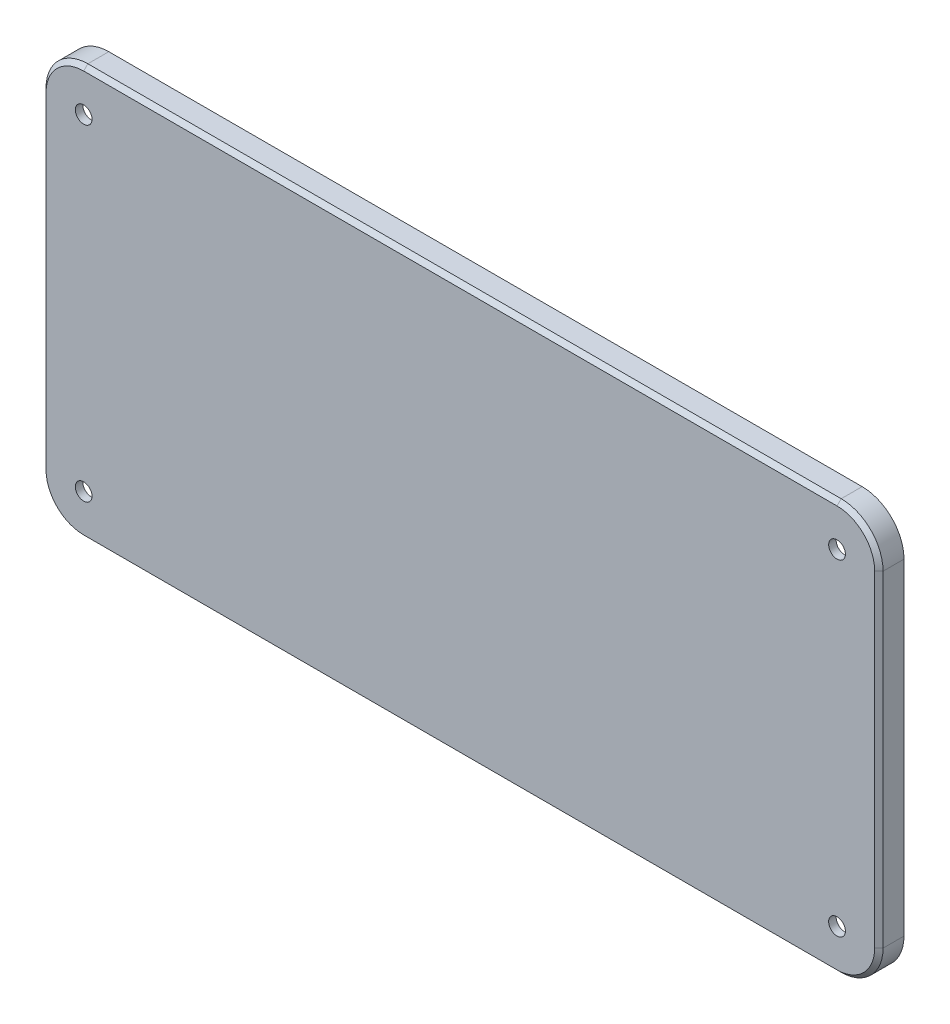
ISO-10303-21;
HEADER;
FILE_DESCRIPTION(('STEP AP214'),'2;1');
FILE_NAME('part.step','',(''),(''),'','','');
FILE_SCHEMA(('AUTOMOTIVE_DESIGN { 1 0 10303 214 1 1 1 1 }'));
ENDSEC;
DATA;
#1=APPLICATION_CONTEXT('core data for automotive mechanical design processes');
#2=APPLICATION_PROTOCOL_DEFINITION('international standard','automotive_design',2000,#1);
#3=PRODUCT_CONTEXT('',#1,'mechanical');
#4=PRODUCT('Part','Part','',(#3));
#5=PRODUCT_RELATED_PRODUCT_CATEGORY('part','',(#4));
#6=PRODUCT_DEFINITION_FORMATION('','',#4);
#7=PRODUCT_DEFINITION_CONTEXT('part definition',#1,'design');
#8=PRODUCT_DEFINITION('design','',#6,#7);
#9=PRODUCT_DEFINITION_SHAPE('','',#8);
#10=(LENGTH_UNIT() NAMED_UNIT(*) SI_UNIT(.MILLI.,.METRE.));
#11=(NAMED_UNIT(*) PLANE_ANGLE_UNIT() SI_UNIT($,.RADIAN.));
#12=(NAMED_UNIT(*) SI_UNIT($,.STERADIAN.) SOLID_ANGLE_UNIT());
#13=UNCERTAINTY_MEASURE_WITH_UNIT(LENGTH_MEASURE(1.E-05),#10,'distance_accuracy_value','');
#14=(GEOMETRIC_REPRESENTATION_CONTEXT(3) GLOBAL_UNCERTAINTY_ASSIGNED_CONTEXT((#13)) GLOBAL_UNIT_ASSIGNED_CONTEXT((#10,
#11,#12)) REPRESENTATION_CONTEXT('',''));
#15=CARTESIAN_POINT('',(0.,0.,0.));
#16=DIRECTION('',(0.,0.,1.));
#17=DIRECTION('',(1.,0.,0.));
#18=AXIS2_PLACEMENT_3D('',#15,#16,#17);
#19=CARTESIAN_POINT('',(-90.0000000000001,-39.,6.));
#20=DIRECTION('',(0.,0.,1.));
#21=DIRECTION('',(1.,0.,0.));
#22=AXIS2_PLACEMENT_3D('',#19,#20,#21);
#23=PLANE('',#22);
#24=CARTESIAN_POINT('',(-90.0000000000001,-39.,6.));
#25=DIRECTION('',(0.,0.,1.));
#26=DIRECTION('',(1.,0.,0.));
#27=AXIS2_PLACEMENT_3D('',#24,#25,#26);
#28=CIRCLE('',#27,9.00000000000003);
#29=CARTESIAN_POINT('',(-99.0000000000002,-39.,6.));
#30=VERTEX_POINT('',#29);
#31=CARTESIAN_POINT('',(-90.0000000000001,-48.,6.));
#32=VERTEX_POINT('',#31);
#33=EDGE_CURVE('E300',#30,#32,#28,.T.);
#34=ORIENTED_EDGE('',*,*,#33,.T.);
#35=DIRECTION('',(1.,0.,0.));
#36=VECTOR('',#35,1.);
#37=CARTESIAN_POINT('',(90.0000000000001,-48.,6.));
#38=LINE('',#37,#36);
#39=CARTESIAN_POINT('',(90.0000000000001,-48.,6.));
#40=VERTEX_POINT('',#39);
#41=EDGE_CURVE('E304',#32,#40,#38,.T.);
#42=ORIENTED_EDGE('',*,*,#41,.T.);
#43=CARTESIAN_POINT('',(90.0000000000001,-39.,6.));
#44=DIRECTION('',(0.,0.,1.));
#45=DIRECTION('',(1.,0.,0.));
#46=AXIS2_PLACEMENT_3D('',#43,#44,#45);
#47=CIRCLE('',#46,9.00000000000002);
#48=CARTESIAN_POINT('',(99.0000000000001,-39.,6.));
#49=VERTEX_POINT('',#48);
#50=EDGE_CURVE('E302',#40,#49,#47,.T.);
#51=ORIENTED_EDGE('',*,*,#50,.T.);
#52=DIRECTION('',(0.,1.,0.));
#53=VECTOR('',#52,1.);
#54=CARTESIAN_POINT('',(99.0000000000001,39.,6.));
#55=LINE('',#54,#53);
#56=CARTESIAN_POINT('',(99.0000000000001,39.,6.));
#57=VERTEX_POINT('',#56);
#58=EDGE_CURVE('E298',#49,#57,#55,.T.);
#59=ORIENTED_EDGE('',*,*,#58,.T.);
#60=CARTESIAN_POINT('',(90.0000000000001,39.,6.));
#61=DIRECTION('',(0.,0.,1.));
#62=DIRECTION('',(1.,0.,0.));
#63=AXIS2_PLACEMENT_3D('',#60,#61,#62);
#64=CIRCLE('',#63,9.00000000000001);
#65=CARTESIAN_POINT('',(90.0000000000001,48.,6.));
#66=VERTEX_POINT('',#65);
#67=EDGE_CURVE('E294',#57,#66,#64,.T.);
#68=ORIENTED_EDGE('',*,*,#67,.T.);
#69=DIRECTION('',(-1.,0.,0.));
#70=VECTOR('',#69,1.);
#71=CARTESIAN_POINT('',(-90.0000000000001,48.,6.));
#72=LINE('',#71,#70);
#73=CARTESIAN_POINT('',(-90.0000000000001,48.,6.));
#74=VERTEX_POINT('',#73);
#75=EDGE_CURVE('E290',#66,#74,#72,.T.);
#76=ORIENTED_EDGE('',*,*,#75,.T.);
#77=CARTESIAN_POINT('',(-90.0000000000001,39.,6.));
#78=DIRECTION('',(0.,0.,1.));
#79=DIRECTION('',(1.,0.,0.));
#80=AXIS2_PLACEMENT_3D('',#77,#78,#79);
#81=CIRCLE('',#80,9.00000000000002);
#82=CARTESIAN_POINT('',(-99.0000000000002,39.,6.));
#83=VERTEX_POINT('',#82);
#84=EDGE_CURVE('E292',#74,#83,#81,.T.);
#85=ORIENTED_EDGE('',*,*,#84,.T.);
#86=DIRECTION('',(0.,-1.,0.));
#87=VECTOR('',#86,1.);
#88=CARTESIAN_POINT('',(-99.0000000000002,-39.,6.));
#89=LINE('',#88,#87);
#90=EDGE_CURVE('E296',#83,#30,#89,.T.);
#91=ORIENTED_EDGE('',*,*,#90,.T.);
#92=EDGE_LOOP('',(#34,#42,#51,#59,#68,#76,#85,#91));
#93=FACE_BOUND('',#92,.T.);
#94=CARTESIAN_POINT('',(89.9999999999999,39.,6.));
#95=DIRECTION('',(0.,0.,1.));
#96=DIRECTION('',(1.,0.,0.));
#97=AXIS2_PLACEMENT_3D('',#94,#95,#96);
#98=CIRCLE('',#97,2.);
#99=CARTESIAN_POINT('',(91.9999999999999,39.,6.));
#100=VERTEX_POINT('',#99);
#101=EDGE_CURVE('E241',#100,#100,#98,.T.);
#102=ORIENTED_EDGE('',*,*,#101,.F.);
#103=EDGE_LOOP('',(#102));
#104=FACE_BOUND('',#103,.T.);
#105=CARTESIAN_POINT('',(-89.9999999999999,-39.,6.));
#106=DIRECTION('',(0.,0.,1.));
#107=DIRECTION('',(1.,0.,0.));
#108=AXIS2_PLACEMENT_3D('',#105,#106,#107);
#109=CIRCLE('',#108,2.);
#110=CARTESIAN_POINT('',(-87.9999999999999,-39.,6.));
#111=VERTEX_POINT('',#110);
#112=EDGE_CURVE('E247',#111,#111,#109,.T.);
#113=ORIENTED_EDGE('',*,*,#112,.F.);
#114=EDGE_LOOP('',(#113));
#115=FACE_BOUND('',#114,.T.);
#116=CARTESIAN_POINT('',(90.0000000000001,-39.,6.));
#117=DIRECTION('',(0.,0.,1.));
#118=DIRECTION('',(1.,0.,0.));
#119=AXIS2_PLACEMENT_3D('',#116,#117,#118);
#120=CIRCLE('',#119,2.);
#121=CARTESIAN_POINT('',(92.0000000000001,-39.,6.));
#122=VERTEX_POINT('',#121);
#123=EDGE_CURVE('E244',#122,#122,#120,.T.);
#124=ORIENTED_EDGE('',*,*,#123,.F.);
#125=EDGE_LOOP('',(#124));
#126=FACE_BOUND('',#125,.T.);
#127=CARTESIAN_POINT('',(-90.0000000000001,39.,6.));
#128=DIRECTION('',(0.,0.,1.));
#129=DIRECTION('',(1.,0.,0.));
#130=AXIS2_PLACEMENT_3D('',#127,#128,#129);
#131=CIRCLE('',#130,2.);
#132=CARTESIAN_POINT('',(-88.0000000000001,39.,6.));
#133=VERTEX_POINT('',#132);
#134=EDGE_CURVE('E238',#133,#133,#131,.T.);
#135=ORIENTED_EDGE('',*,*,#134,.F.);
#136=EDGE_LOOP('',(#135));
#137=FACE_BOUND('',#136,.T.);
#138=ADVANCED_FACE('F33',(#93,#104,#115,#126,#137),#23,.T.);
#139=CARTESIAN_POINT('',(-90.0000000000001,-39.,0.));
#140=DIRECTION('',(0.,0.,1.));
#141=DIRECTION('',(1.,0.,0.));
#142=AXIS2_PLACEMENT_3D('',#139,#140,#141);
#143=PLANE('',#142);
#144=DIRECTION('',(0.,-1.,0.));
#145=VECTOR('',#144,1.);
#146=CARTESIAN_POINT('',(-98.2000000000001,-39.,0.));
#147=LINE('',#146,#145);
#148=CARTESIAN_POINT('',(-98.2000000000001,39.,0.));
#149=VERTEX_POINT('',#148);
#150=CARTESIAN_POINT('',(-98.2000000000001,-39.,0.));
#151=VERTEX_POINT('',#150);
#152=EDGE_CURVE('E198',#149,#151,#147,.T.);
#153=ORIENTED_EDGE('',*,*,#152,.T.);
#154=CARTESIAN_POINT('',(-90.0000000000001,-39.,0.));
#155=DIRECTION('',(0.,0.,1.));
#156=DIRECTION('',(1.,0.,0.));
#157=AXIS2_PLACEMENT_3D('',#154,#155,#156);
#158=CIRCLE('',#157,8.2);
#159=CARTESIAN_POINT('',(-90.0000000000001,-47.2,0.));
#160=VERTEX_POINT('',#159);
#161=EDGE_CURVE('E207',#151,#160,#158,.T.);
#162=ORIENTED_EDGE('',*,*,#161,.T.);
#163=DIRECTION('',(1.,0.,0.));
#164=VECTOR('',#163,1.);
#165=CARTESIAN_POINT('',(90.0000000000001,-47.2,0.));
#166=LINE('',#165,#164);
#167=CARTESIAN_POINT('',(90.0000000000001,-47.2,0.));
#168=VERTEX_POINT('',#167);
#169=EDGE_CURVE('E214',#160,#168,#166,.T.);
#170=ORIENTED_EDGE('',*,*,#169,.T.);
#171=CARTESIAN_POINT('',(90.0000000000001,-39.,0.));
#172=DIRECTION('',(0.,0.,1.));
#173=DIRECTION('',(1.,0.,0.));
#174=AXIS2_PLACEMENT_3D('',#171,#172,#173);
#175=CIRCLE('',#174,8.19999999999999);
#176=CARTESIAN_POINT('',(98.2000000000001,-39.,0.));
#177=VERTEX_POINT('',#176);
#178=EDGE_CURVE('E234',#168,#177,#175,.T.);
#179=ORIENTED_EDGE('',*,*,#178,.T.);
#180=DIRECTION('',(0.,1.,0.));
#181=VECTOR('',#180,1.);
#182=CARTESIAN_POINT('',(98.2000000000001,-39.,0.));
#183=LINE('',#182,#181);
#184=CARTESIAN_POINT('',(98.2000000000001,39.,0.));
#185=VERTEX_POINT('',#184);
#186=EDGE_CURVE('E231',#177,#185,#183,.T.);
#187=ORIENTED_EDGE('',*,*,#186,.T.);
#188=CARTESIAN_POINT('',(90.0000000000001,39.,0.));
#189=DIRECTION('',(0.,0.,1.));
#190=DIRECTION('',(1.,0.,0.));
#191=AXIS2_PLACEMENT_3D('',#188,#189,#190);
#192=CIRCLE('',#191,8.19999999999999);
#193=CARTESIAN_POINT('',(90.0000000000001,47.2,0.));
#194=VERTEX_POINT('',#193);
#195=EDGE_CURVE('E228',#185,#194,#192,.T.);
#196=ORIENTED_EDGE('',*,*,#195,.T.);
#197=DIRECTION('',(-1.,0.,0.));
#198=VECTOR('',#197,1.);
#199=CARTESIAN_POINT('',(90.0000000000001,47.2,0.));
#200=LINE('',#199,#198);
#201=CARTESIAN_POINT('',(-90.0000000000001,47.2,0.));
#202=VERTEX_POINT('',#201);
#203=EDGE_CURVE('E223',#194,#202,#200,.T.);
#204=ORIENTED_EDGE('',*,*,#203,.T.);
#205=CARTESIAN_POINT('',(-90.0000000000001,39.,0.));
#206=DIRECTION('',(0.,0.,1.));
#207=DIRECTION('',(1.,0.,0.));
#208=AXIS2_PLACEMENT_3D('',#205,#206,#207);
#209=CIRCLE('',#208,8.2);
#210=EDGE_CURVE('E221',#202,#149,#209,.T.);
#211=ORIENTED_EDGE('',*,*,#210,.T.);
#212=EDGE_LOOP('',(#153,#162,#170,#179,#187,#196,#204,#211));
#213=FACE_BOUND('',#212,.T.);
#214=CARTESIAN_POINT('',(-90.0000000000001,-39.,0.));
#215=DIRECTION('',(0.,0.,1.));
#216=DIRECTION('',(1.,0.,0.));
#217=AXIS2_PLACEMENT_3D('',#214,#215,#216);
#218=CIRCLE('',#217,10.);
#219=CARTESIAN_POINT('',(-100.,-39.,0.));
#220=VERTEX_POINT('',#219);
#221=CARTESIAN_POINT('',(-90.0000000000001,-49.,0.));
#222=VERTEX_POINT('',#221);
#223=EDGE_CURVE('E250',#220,#222,#218,.T.);
#224=ORIENTED_EDGE('',*,*,#223,.F.);
#225=DIRECTION('',(0.,-1.,0.));
#226=VECTOR('',#225,1.);
#227=CARTESIAN_POINT('',(-100.,-39.,0.));
#228=LINE('',#227,#226);
#229=CARTESIAN_POINT('',(-100.,39.,0.));
#230=VERTEX_POINT('',#229);
#231=EDGE_CURVE('E271',#230,#220,#228,.T.);
#232=ORIENTED_EDGE('',*,*,#231,.F.);
#233=CARTESIAN_POINT('',(-90.0000000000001,39.,0.));
#234=DIRECTION('',(0.,0.,1.));
#235=DIRECTION('',(1.,0.,0.));
#236=AXIS2_PLACEMENT_3D('',#233,#234,#235);
#237=CIRCLE('',#236,9.99999999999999);
#238=CARTESIAN_POINT('',(-90.0000000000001,49.,0.));
#239=VERTEX_POINT('',#238);
#240=EDGE_CURVE('E268',#239,#230,#237,.T.);
#241=ORIENTED_EDGE('',*,*,#240,.F.);
#242=DIRECTION('',(-1.,0.,0.));
#243=VECTOR('',#242,1.);
#244=CARTESIAN_POINT('',(90.0000000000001,49.,0.));
#245=LINE('',#244,#243);
#246=CARTESIAN_POINT('',(90.0000000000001,49.,0.));
#247=VERTEX_POINT('',#246);
#248=EDGE_CURVE('E265',#247,#239,#245,.T.);
#249=ORIENTED_EDGE('',*,*,#248,.F.);
#250=CARTESIAN_POINT('',(90.0000000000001,39.,0.));
#251=DIRECTION('',(0.,0.,1.));
#252=DIRECTION('',(1.,0.,0.));
#253=AXIS2_PLACEMENT_3D('',#250,#251,#252);
#254=CIRCLE('',#253,9.99999999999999);
#255=CARTESIAN_POINT('',(100.,39.,0.));
#256=VERTEX_POINT('',#255);
#257=EDGE_CURVE('E262',#256,#247,#254,.T.);
#258=ORIENTED_EDGE('',*,*,#257,.F.);
#259=DIRECTION('',(0.,1.,0.));
#260=VECTOR('',#259,1.);
#261=CARTESIAN_POINT('',(100.,-39.,0.));
#262=LINE('',#261,#260);
#263=CARTESIAN_POINT('',(100.,-39.,0.));
#264=VERTEX_POINT('',#263);
#265=EDGE_CURVE('E259',#264,#256,#262,.T.);
#266=ORIENTED_EDGE('',*,*,#265,.F.);
#267=CARTESIAN_POINT('',(90.0000000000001,-39.,0.));
#268=DIRECTION('',(0.,0.,1.));
#269=DIRECTION('',(1.,0.,0.));
#270=AXIS2_PLACEMENT_3D('',#267,#268,#269);
#271=CIRCLE('',#270,9.99999999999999);
#272=CARTESIAN_POINT('',(90.0000000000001,-49.,0.));
#273=VERTEX_POINT('',#272);
#274=EDGE_CURVE('E256',#273,#264,#271,.T.);
#275=ORIENTED_EDGE('',*,*,#274,.F.);
#276=DIRECTION('',(1.,0.,0.));
#277=VECTOR('',#276,1.);
#278=CARTESIAN_POINT('',(90.0000000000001,-49.,0.));
#279=LINE('',#278,#277);
#280=EDGE_CURVE('E253',#222,#273,#279,.T.);
#281=ORIENTED_EDGE('',*,*,#280,.F.);
#282=EDGE_LOOP('',(#224,#232,#241,#249,#258,#266,#275,#281));
#283=FACE_BOUND('',#282,.T.);
#284=ADVANCED_FACE('F217',(#213,#283),#143,.F.);
#285=CARTESIAN_POINT('',(-90.0000000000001,-39.,6.));
#286=DIRECTION('',(0.,0.,-1.));
#287=DIRECTION('',(-1.,0.,0.));
#288=AXIS2_PLACEMENT_3D('',#285,#286,#287);
#289=CYLINDRICAL_SURFACE('',#288,10.);
#290=DIRECTION('',(0.,0.,-1.));
#291=VECTOR('',#290,1.);
#292=CARTESIAN_POINT('',(-90.0000000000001,-49.,6.));
#293=LINE('',#292,#291);
#294=CARTESIAN_POINT('',(-90.0000000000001,-49.,5.));
#295=VERTEX_POINT('',#294);
#296=EDGE_CURVE('E288',#295,#222,#293,.T.);
#297=ORIENTED_EDGE('',*,*,#296,.F.);
#298=CARTESIAN_POINT('',(-90.0000000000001,-39.,5.));
#299=DIRECTION('',(0.,0.,1.));
#300=DIRECTION('',(1.,0.,0.));
#301=AXIS2_PLACEMENT_3D('',#298,#299,#300);
#302=CIRCLE('',#301,10.);
#303=CARTESIAN_POINT('',(-100.,-39.,5.));
#304=VERTEX_POINT('',#303);
#305=EDGE_CURVE('E312',#295,#304,#302,.F.);
#306=ORIENTED_EDGE('',*,*,#305,.T.);
#307=DIRECTION('',(0.,0.,-1.));
#308=VECTOR('',#307,1.);
#309=CARTESIAN_POINT('',(-100.,-39.,6.));
#310=LINE('',#309,#308);
#311=EDGE_CURVE('E274',#304,#220,#310,.T.);
#312=ORIENTED_EDGE('',*,*,#311,.T.);
#313=ORIENTED_EDGE('',*,*,#223,.T.);
#314=EDGE_LOOP('',(#297,#306,#312,#313));
#315=FACE_BOUND('',#314,.T.);
#316=ADVANCED_FACE('F465',(#315),#289,.T.);
#317=CARTESIAN_POINT('',(90.0000000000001,-49.,6.));
#318=DIRECTION('',(0.,1.,0.));
#319=DIRECTION('',(0.,0.,1.));
#320=AXIS2_PLACEMENT_3D('',#317,#318,#319);
#321=PLANE('',#320);
#322=DIRECTION('',(0.,0.,-1.));
#323=VECTOR('',#322,1.);
#324=CARTESIAN_POINT('',(90.0000000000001,-49.,6.));
#325=LINE('',#324,#323);
#326=CARTESIAN_POINT('',(90.0000000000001,-49.,5.));
#327=VERTEX_POINT('',#326);
#328=EDGE_CURVE('E286',#327,#273,#325,.T.);
#329=ORIENTED_EDGE('',*,*,#328,.F.);
#330=DIRECTION('',(-1.,0.,0.));
#331=VECTOR('',#330,1.);
#332=CARTESIAN_POINT('',(-90.0000000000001,-49.,5.));
#333=LINE('',#332,#331);
#334=EDGE_CURVE('E307',#327,#295,#333,.T.);
#335=ORIENTED_EDGE('',*,*,#334,.T.);
#336=ORIENTED_EDGE('',*,*,#296,.T.);
#337=ORIENTED_EDGE('',*,*,#280,.T.);
#338=EDGE_LOOP('',(#329,#335,#336,#337));
#339=FACE_BOUND('',#338,.T.);
#340=ADVANCED_FACE('F495',(#339),#321,.F.);
#341=CARTESIAN_POINT('',(90.0000000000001,-39.,6.));
#342=DIRECTION('',(0.,0.,-1.));
#343=DIRECTION('',(-1.,0.,0.));
#344=AXIS2_PLACEMENT_3D('',#341,#342,#343);
#345=CYLINDRICAL_SURFACE('',#344,9.99999999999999);
#346=DIRECTION('',(0.,0.,-1.));
#347=VECTOR('',#346,1.);
#348=CARTESIAN_POINT('',(100.,-39.,6.));
#349=LINE('',#348,#347);
#350=CARTESIAN_POINT('',(100.,-39.,5.));
#351=VERTEX_POINT('',#350);
#352=EDGE_CURVE('E284',#351,#264,#349,.T.);
#353=ORIENTED_EDGE('',*,*,#352,.F.);
#354=CARTESIAN_POINT('',(90.0000000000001,-39.,5.));
#355=DIRECTION('',(0.,0.,1.));
#356=DIRECTION('',(1.,0.,0.));
#357=AXIS2_PLACEMENT_3D('',#354,#355,#356);
#358=CIRCLE('',#357,9.99999999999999);
#359=EDGE_CURVE('E310',#351,#327,#358,.F.);
#360=ORIENTED_EDGE('',*,*,#359,.T.);
#361=ORIENTED_EDGE('',*,*,#328,.T.);
#362=ORIENTED_EDGE('',*,*,#274,.T.);
#363=EDGE_LOOP('',(#353,#360,#361,#362));
#364=FACE_BOUND('',#363,.T.);
#365=ADVANCED_FACE('F491',(#364),#345,.T.);
#366=CARTESIAN_POINT('',(100.,-39.,6.));
#367=DIRECTION('',(-1.,0.,0.));
#368=DIRECTION('',(0.,0.,1.));
#369=AXIS2_PLACEMENT_3D('',#366,#367,#368);
#370=PLANE('',#369);
#371=DIRECTION('',(0.,0.,-1.));
#372=VECTOR('',#371,1.);
#373=CARTESIAN_POINT('',(100.,39.,6.));
#374=LINE('',#373,#372);
#375=CARTESIAN_POINT('',(100.,39.,5.));
#376=VERTEX_POINT('',#375);
#377=EDGE_CURVE('E282',#376,#256,#374,.T.);
#378=ORIENTED_EDGE('',*,*,#377,.F.);
#379=DIRECTION('',(0.,-1.,0.));
#380=VECTOR('',#379,1.);
#381=CARTESIAN_POINT('',(100.,-39.,5.));
#382=LINE('',#381,#380);
#383=EDGE_CURVE('E314',#376,#351,#382,.T.);
#384=ORIENTED_EDGE('',*,*,#383,.T.);
#385=ORIENTED_EDGE('',*,*,#352,.T.);
#386=ORIENTED_EDGE('',*,*,#265,.T.);
#387=EDGE_LOOP('',(#378,#384,#385,#386));
#388=FACE_BOUND('',#387,.T.);
#389=ADVANCED_FACE('F487',(#388),#370,.F.);
#390=CARTESIAN_POINT('',(90.0000000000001,39.,6.));
#391=DIRECTION('',(0.,0.,-1.));
#392=DIRECTION('',(-1.,0.,0.));
#393=AXIS2_PLACEMENT_3D('',#390,#391,#392);
#394=CYLINDRICAL_SURFACE('',#393,9.99999999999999);
#395=DIRECTION('',(0.,0.,-1.));
#396=VECTOR('',#395,1.);
#397=CARTESIAN_POINT('',(90.0000000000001,49.,6.));
#398=LINE('',#397,#396);
#399=CARTESIAN_POINT('',(90.0000000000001,49.,5.));
#400=VERTEX_POINT('',#399);
#401=EDGE_CURVE('E280',#400,#247,#398,.T.);
#402=ORIENTED_EDGE('',*,*,#401,.F.);
#403=CARTESIAN_POINT('',(90.0000000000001,39.,5.));
#404=DIRECTION('',(0.,0.,1.));
#405=DIRECTION('',(1.,0.,0.));
#406=AXIS2_PLACEMENT_3D('',#403,#404,#405);
#407=CIRCLE('',#406,9.99999999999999);
#408=EDGE_CURVE('E318',#400,#376,#407,.F.);
#409=ORIENTED_EDGE('',*,*,#408,.T.);
#410=ORIENTED_EDGE('',*,*,#377,.T.);
#411=ORIENTED_EDGE('',*,*,#257,.T.);
#412=EDGE_LOOP('',(#402,#409,#410,#411));
#413=FACE_BOUND('',#412,.T.);
#414=ADVANCED_FACE('F483',(#413),#394,.T.);
#415=CARTESIAN_POINT('',(90.0000000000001,49.,6.));
#416=DIRECTION('',(0.,-1.,0.));
#417=DIRECTION('',(1.,0.,0.));
#418=AXIS2_PLACEMENT_3D('',#415,#416,#417);
#419=PLANE('',#418);
#420=DIRECTION('',(0.,0.,-1.));
#421=VECTOR('',#420,1.);
#422=CARTESIAN_POINT('',(-90.0000000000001,49.,6.));
#423=LINE('',#422,#421);
#424=CARTESIAN_POINT('',(-90.0000000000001,49.,5.));
#425=VERTEX_POINT('',#424);
#426=EDGE_CURVE('E278',#425,#239,#423,.T.);
#427=ORIENTED_EDGE('',*,*,#426,.F.);
#428=DIRECTION('',(1.,0.,0.));
#429=VECTOR('',#428,1.);
#430=CARTESIAN_POINT('',(90.0000000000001,49.,5.));
#431=LINE('',#430,#429);
#432=EDGE_CURVE('E322',#425,#400,#431,.T.);
#433=ORIENTED_EDGE('',*,*,#432,.T.);
#434=ORIENTED_EDGE('',*,*,#401,.T.);
#435=ORIENTED_EDGE('',*,*,#248,.T.);
#436=EDGE_LOOP('',(#427,#433,#434,#435));
#437=FACE_BOUND('',#436,.T.);
#438=ADVANCED_FACE('F479',(#437),#419,.F.);
#439=CARTESIAN_POINT('',(-90.0000000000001,39.,6.));
#440=DIRECTION('',(0.,0.,-1.));
#441=DIRECTION('',(-1.,0.,0.));
#442=AXIS2_PLACEMENT_3D('',#439,#440,#441);
#443=CYLINDRICAL_SURFACE('',#442,9.99999999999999);
#444=DIRECTION('',(0.,0.,-1.));
#445=VECTOR('',#444,1.);
#446=CARTESIAN_POINT('',(-100.,39.,6.));
#447=LINE('',#446,#445);
#448=CARTESIAN_POINT('',(-100.,39.,5.));
#449=VERTEX_POINT('',#448);
#450=EDGE_CURVE('E276',#449,#230,#447,.T.);
#451=ORIENTED_EDGE('',*,*,#450,.F.);
#452=CARTESIAN_POINT('',(-90.0000000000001,39.,5.));
#453=DIRECTION('',(0.,0.,1.));
#454=DIRECTION('',(1.,0.,0.));
#455=AXIS2_PLACEMENT_3D('',#452,#453,#454);
#456=CIRCLE('',#455,9.99999999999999);
#457=EDGE_CURVE('E320',#449,#425,#456,.F.);
#458=ORIENTED_EDGE('',*,*,#457,.T.);
#459=ORIENTED_EDGE('',*,*,#426,.T.);
#460=ORIENTED_EDGE('',*,*,#240,.T.);
#461=EDGE_LOOP('',(#451,#458,#459,#460));
#462=FACE_BOUND('',#461,.T.);
#463=ADVANCED_FACE('F475',(#462),#443,.T.);
#464=CARTESIAN_POINT('',(-100.,-39.,6.));
#465=DIRECTION('',(1.,0.,0.));
#466=DIRECTION('',(0.,0.,-1.));
#467=AXIS2_PLACEMENT_3D('',#464,#465,#466);
#468=PLANE('',#467);
#469=ORIENTED_EDGE('',*,*,#311,.F.);
#470=DIRECTION('',(0.,1.,0.));
#471=VECTOR('',#470,1.);
#472=CARTESIAN_POINT('',(-100.,39.,5.));
#473=LINE('',#472,#471);
#474=EDGE_CURVE('E316',#304,#449,#473,.T.);
#475=ORIENTED_EDGE('',*,*,#474,.T.);
#476=ORIENTED_EDGE('',*,*,#450,.T.);
#477=ORIENTED_EDGE('',*,*,#231,.T.);
#478=EDGE_LOOP('',(#469,#475,#476,#477));
#479=FACE_BOUND('',#478,.T.);
#480=ADVANCED_FACE('F472',(#479),#468,.F.);
#481=CARTESIAN_POINT('',(-89.9999999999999,-39.,6.));
#482=DIRECTION('',(0.,0.,-1.));
#483=DIRECTION('',(-1.,0.,0.));
#484=AXIS2_PLACEMENT_3D('',#481,#482,#483);
#485=CYLINDRICAL_SURFACE('',#484,2.);
#486=CARTESIAN_POINT('',(-89.9999999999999,-39.,4.2));
#487=DIRECTION('',(0.,0.,1.));
#488=DIRECTION('',(1.,0.,0.));
#489=AXIS2_PLACEMENT_3D('',#486,#487,#488);
#490=CIRCLE('',#489,2.);
#491=CARTESIAN_POINT('',(-87.9999999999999,-39.,4.2));
#492=VERTEX_POINT('',#491);
#493=EDGE_CURVE('E215',#492,#492,#490,.T.);
#494=ORIENTED_EDGE('',*,*,#493,.F.);
#495=EDGE_LOOP('',(#494));
#496=FACE_BOUND('',#495,.T.);
#497=ORIENTED_EDGE('',*,*,#112,.T.);
#498=EDGE_LOOP('',(#497));
#499=FACE_BOUND('',#498,.T.);
#500=ADVANCED_FACE('F469',(#496,#499),#485,.F.);
#501=CARTESIAN_POINT('',(90.0000000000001,-39.,6.));
#502=DIRECTION('',(0.,0.,-1.));
#503=DIRECTION('',(-1.,0.,0.));
#504=AXIS2_PLACEMENT_3D('',#501,#502,#503);
#505=CYLINDRICAL_SURFACE('',#504,2.);
#506=CARTESIAN_POINT('',(90.0000000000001,-39.,4.2));
#507=DIRECTION('',(0.,0.,1.));
#508=DIRECTION('',(1.,0.,0.));
#509=AXIS2_PLACEMENT_3D('',#506,#507,#508);
#510=CIRCLE('',#509,2.);
#511=CARTESIAN_POINT('',(92.0000000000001,-39.,4.2));
#512=VERTEX_POINT('',#511);
#513=EDGE_CURVE('E444',#512,#512,#510,.T.);
#514=ORIENTED_EDGE('',*,*,#513,.F.);
#515=EDGE_LOOP('',(#514));
#516=FACE_BOUND('',#515,.T.);
#517=ORIENTED_EDGE('',*,*,#123,.T.);
#518=EDGE_LOOP('',(#517));
#519=FACE_BOUND('',#518,.T.);
#520=ADVANCED_FACE('F662',(#516,#519),#505,.F.);
#521=CARTESIAN_POINT('',(89.9999999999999,39.,6.));
#522=DIRECTION('',(0.,0.,-1.));
#523=DIRECTION('',(-1.,0.,0.));
#524=AXIS2_PLACEMENT_3D('',#521,#522,#523);
#525=CYLINDRICAL_SURFACE('',#524,2.);
#526=CARTESIAN_POINT('',(89.9999999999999,39.,4.2));
#527=DIRECTION('',(0.,0.,1.));
#528=DIRECTION('',(1.,0.,0.));
#529=AXIS2_PLACEMENT_3D('',#526,#527,#528);
#530=CIRCLE('',#529,2.);
#531=CARTESIAN_POINT('',(91.9999999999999,39.,4.2));
#532=VERTEX_POINT('',#531);
#533=EDGE_CURVE('E441',#532,#532,#530,.T.);
#534=ORIENTED_EDGE('',*,*,#533,.F.);
#535=EDGE_LOOP('',(#534));
#536=FACE_BOUND('',#535,.T.);
#537=ORIENTED_EDGE('',*,*,#101,.T.);
#538=EDGE_LOOP('',(#537));
#539=FACE_BOUND('',#538,.T.);
#540=ADVANCED_FACE('F455',(#536,#539),#525,.F.);
#541=CARTESIAN_POINT('',(-90.0000000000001,39.,6.));
#542=DIRECTION('',(0.,0.,-1.));
#543=DIRECTION('',(-1.,0.,0.));
#544=AXIS2_PLACEMENT_3D('',#541,#542,#543);
#545=CYLINDRICAL_SURFACE('',#544,2.);
#546=CARTESIAN_POINT('',(-90.0000000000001,39.,4.2));
#547=DIRECTION('',(0.,0.,1.));
#548=DIRECTION('',(1.,0.,0.));
#549=AXIS2_PLACEMENT_3D('',#546,#547,#548);
#550=CIRCLE('',#549,2.);
#551=CARTESIAN_POINT('',(-88.0000000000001,39.,4.2));
#552=VERTEX_POINT('',#551);
#553=EDGE_CURVE('E347',#552,#552,#550,.T.);
#554=ORIENTED_EDGE('',*,*,#553,.F.);
#555=EDGE_LOOP('',(#554));
#556=FACE_BOUND('',#555,.T.);
#557=ORIENTED_EDGE('',*,*,#134,.T.);
#558=EDGE_LOOP('',(#557));
#559=FACE_BOUND('',#558,.T.);
#560=ADVANCED_FACE('F452',(#556,#559),#545,.F.);
#561=CARTESIAN_POINT('',(-90.0000000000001,-39.,4.2));
#562=DIRECTION('',(0.,0.,1.));
#563=DIRECTION('',(1.,0.,0.));
#564=AXIS2_PLACEMENT_3D('',#561,#562,#563);
#565=PLANE('',#564);
#566=DIRECTION('',(-1.,0.,0.));
#567=VECTOR('',#566,1.);
#568=CARTESIAN_POINT('',(-90.0000000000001,45.4,4.2));
#569=LINE('',#568,#567);
#570=CARTESIAN_POINT('',(-90.0000000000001,45.4,4.2));
#571=VERTEX_POINT('',#570);
#572=CARTESIAN_POINT('',(90.0000000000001,45.4,4.2));
#573=VERTEX_POINT('',#572);
#574=EDGE_CURVE('E350',#571,#573,#569,.F.);
#575=ORIENTED_EDGE('',*,*,#574,.T.);
#576=CARTESIAN_POINT('',(90.0000000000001,39.,4.2));
#577=DIRECTION('',(0.,0.,1.));
#578=DIRECTION('',(1.,0.,0.));
#579=AXIS2_PLACEMENT_3D('',#576,#577,#578);
#580=CIRCLE('',#579,6.39999999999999);
#581=CARTESIAN_POINT('',(96.4000000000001,39.,4.2));
#582=VERTEX_POINT('',#581);
#583=EDGE_CURVE('E364',#573,#582,#580,.F.);
#584=ORIENTED_EDGE('',*,*,#583,.T.);
#585=DIRECTION('',(0.,1.,0.));
#586=VECTOR('',#585,1.);
#587=CARTESIAN_POINT('',(96.4000000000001,-39.,4.2));
#588=LINE('',#587,#586);
#589=CARTESIAN_POINT('',(96.4000000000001,-39.,4.2));
#590=VERTEX_POINT('',#589);
#591=EDGE_CURVE('E362',#582,#590,#588,.F.);
#592=ORIENTED_EDGE('',*,*,#591,.T.);
#593=CARTESIAN_POINT('',(90.0000000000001,-39.,4.2));
#594=DIRECTION('',(0.,0.,1.));
#595=DIRECTION('',(1.,0.,0.));
#596=AXIS2_PLACEMENT_3D('',#593,#594,#595);
#597=CIRCLE('',#596,6.39999999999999);
#598=CARTESIAN_POINT('',(90.0000000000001,-45.4,4.2));
#599=VERTEX_POINT('',#598);
#600=EDGE_CURVE('E360',#590,#599,#597,.F.);
#601=ORIENTED_EDGE('',*,*,#600,.T.);
#602=DIRECTION('',(1.,0.,0.));
#603=VECTOR('',#602,1.);
#604=CARTESIAN_POINT('',(-90.0000000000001,-45.4,4.2));
#605=LINE('',#604,#603);
#606=CARTESIAN_POINT('',(-90.0000000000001,-45.4,4.2));
#607=VERTEX_POINT('',#606);
#608=EDGE_CURVE('E358',#599,#607,#605,.F.);
#609=ORIENTED_EDGE('',*,*,#608,.T.);
#610=CARTESIAN_POINT('',(-90.0000000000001,-39.,4.2));
#611=DIRECTION('',(0.,0.,1.));
#612=DIRECTION('',(1.,0.,0.));
#613=AXIS2_PLACEMENT_3D('',#610,#611,#612);
#614=CIRCLE('',#613,6.4);
#615=CARTESIAN_POINT('',(-96.4000000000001,-39.,4.2));
#616=VERTEX_POINT('',#615);
#617=EDGE_CURVE('E356',#607,#616,#614,.F.);
#618=ORIENTED_EDGE('',*,*,#617,.T.);
#619=DIRECTION('',(0.,-1.,0.));
#620=VECTOR('',#619,1.);
#621=CARTESIAN_POINT('',(-96.4000000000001,-39.,4.2));
#622=LINE('',#621,#620);
#623=CARTESIAN_POINT('',(-96.4000000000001,39.,4.2));
#624=VERTEX_POINT('',#623);
#625=EDGE_CURVE('E354',#616,#624,#622,.F.);
#626=ORIENTED_EDGE('',*,*,#625,.T.);
#627=CARTESIAN_POINT('',(-90.0000000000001,39.,4.2));
#628=DIRECTION('',(0.,0.,1.));
#629=DIRECTION('',(1.,0.,0.));
#630=AXIS2_PLACEMENT_3D('',#627,#628,#629);
#631=CIRCLE('',#630,6.4);
#632=EDGE_CURVE('E352',#624,#571,#631,.F.);
#633=ORIENTED_EDGE('',*,*,#632,.T.);
#634=EDGE_LOOP('',(#575,#584,#592,#601,#609,#618,#626,#633));
#635=FACE_BOUND('',#634,.T.);
#636=ORIENTED_EDGE('',*,*,#533,.T.);
#637=EDGE_LOOP('',(#636));
#638=FACE_BOUND('',#637,.T.);
#639=ORIENTED_EDGE('',*,*,#493,.T.);
#640=EDGE_LOOP('',(#639));
#641=FACE_BOUND('',#640,.T.);
#642=ORIENTED_EDGE('',*,*,#513,.T.);
#643=EDGE_LOOP('',(#642));
#644=FACE_BOUND('',#643,.T.);
#645=ORIENTED_EDGE('',*,*,#553,.T.);
#646=EDGE_LOOP('',(#645));
#647=FACE_BOUND('',#646,.T.);
#648=ADVANCED_FACE('F407',(#635,#638,#641,#644,#647),#565,.F.);
#649=CARTESIAN_POINT('',(-90.0000000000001,-39.,6.));
#650=DIRECTION('',(0.,0.,-1.));
#651=DIRECTION('',(-1.,0.,0.));
#652=AXIS2_PLACEMENT_3D('',#649,#650,#651);
#653=CYLINDRICAL_SURFACE('',#652,8.2);
#654=DIRECTION('',(0.,0.,-1.));
#655=VECTOR('',#654,1.);
#656=CARTESIAN_POINT('',(-98.2000000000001,-39.,6.));
#657=LINE('',#656,#655);
#658=CARTESIAN_POINT('',(-98.2000000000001,-39.,2.4));
#659=VERTEX_POINT('',#658);
#660=EDGE_CURVE('E194',#659,#151,#657,.T.);
#661=ORIENTED_EDGE('',*,*,#660,.F.);
#662=CARTESIAN_POINT('',(-90.0000000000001,-39.,2.4));
#663=DIRECTION('',(0.,0.,1.));
#664=DIRECTION('',(1.,0.,0.));
#665=AXIS2_PLACEMENT_3D('',#662,#663,#664);
#666=CIRCLE('',#665,8.2);
#667=CARTESIAN_POINT('',(-90.0000000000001,-47.2,2.4));
#668=VERTEX_POINT('',#667);
#669=EDGE_CURVE('E373',#659,#668,#666,.T.);
#670=ORIENTED_EDGE('',*,*,#669,.T.);
#671=DIRECTION('',(0.,0.,1.));
#672=VECTOR('',#671,1.);
#673=CARTESIAN_POINT('',(-90.0000000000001,-47.2,6.));
#674=LINE('',#673,#672);
#675=EDGE_CURVE('E210',#668,#160,#674,.F.);
#676=ORIENTED_EDGE('',*,*,#675,.T.);
#677=ORIENTED_EDGE('',*,*,#161,.F.);
#678=EDGE_LOOP('',(#661,#670,#676,#677));
#679=FACE_BOUND('',#678,.T.);
#680=ADVANCED_FACE('F208',(#679),#653,.F.);
#681=CARTESIAN_POINT('',(90.0000000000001,-47.2,6.));
#682=DIRECTION('',(0.,1.,0.));
#683=DIRECTION('',(0.,0.,1.));
#684=AXIS2_PLACEMENT_3D('',#681,#682,#683);
#685=PLANE('',#684);
#686=ORIENTED_EDGE('',*,*,#675,.F.);
#687=DIRECTION('',(1.,0.,0.));
#688=VECTOR('',#687,1.);
#689=CARTESIAN_POINT('',(90.0000000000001,-47.2,2.4));
#690=LINE('',#689,#688);
#691=CARTESIAN_POINT('',(90.0000000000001,-47.2,2.4));
#692=VERTEX_POINT('',#691);
#693=EDGE_CURVE('E371',#668,#692,#690,.T.);
#694=ORIENTED_EDGE('',*,*,#693,.T.);
#695=DIRECTION('',(0.,0.,-1.));
#696=VECTOR('',#695,1.);
#697=CARTESIAN_POINT('',(90.0000000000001,-47.2,6.));
#698=LINE('',#697,#696);
#699=EDGE_CURVE('E433',#692,#168,#698,.T.);
#700=ORIENTED_EDGE('',*,*,#699,.T.);
#701=ORIENTED_EDGE('',*,*,#169,.F.);
#702=EDGE_LOOP('',(#686,#694,#700,#701));
#703=FACE_BOUND('',#702,.T.);
#704=ADVANCED_FACE('F632',(#703),#685,.T.);
#705=CARTESIAN_POINT('',(90.0000000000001,-39.,6.));
#706=DIRECTION('',(0.,0.,-1.));
#707=DIRECTION('',(-1.,0.,0.));
#708=AXIS2_PLACEMENT_3D('',#705,#706,#707);
#709=CYLINDRICAL_SURFACE('',#708,8.19999999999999);
#710=ORIENTED_EDGE('',*,*,#699,.F.);
#711=CARTESIAN_POINT('',(90.0000000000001,-39.,2.4));
#712=DIRECTION('',(0.,0.,1.));
#713=DIRECTION('',(1.,0.,0.));
#714=AXIS2_PLACEMENT_3D('',#711,#712,#713);
#715=CIRCLE('',#714,8.19999999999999);
#716=CARTESIAN_POINT('',(98.2000000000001,-39.,2.4));
#717=VERTEX_POINT('',#716);
#718=EDGE_CURVE('E369',#692,#717,#715,.T.);
#719=ORIENTED_EDGE('',*,*,#718,.T.);
#720=DIRECTION('',(0.,0.,1.));
#721=VECTOR('',#720,1.);
#722=CARTESIAN_POINT('',(98.2000000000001,-39.,6.));
#723=LINE('',#722,#721);
#724=EDGE_CURVE('E428',#717,#177,#723,.F.);
#725=ORIENTED_EDGE('',*,*,#724,.T.);
#726=ORIENTED_EDGE('',*,*,#178,.F.);
#727=EDGE_LOOP('',(#710,#719,#725,#726));
#728=FACE_BOUND('',#727,.T.);
#729=ADVANCED_FACE('F625',(#728),#709,.F.);
#730=CARTESIAN_POINT('',(98.2000000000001,-39.,6.));
#731=DIRECTION('',(-1.,0.,0.));
#732=DIRECTION('',(0.,0.,1.));
#733=AXIS2_PLACEMENT_3D('',#730,#731,#732);
#734=PLANE('',#733);
#735=ORIENTED_EDGE('',*,*,#724,.F.);
#736=DIRECTION('',(0.,1.,0.));
#737=VECTOR('',#736,1.);
#738=CARTESIAN_POINT('',(98.2000000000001,-39.,2.4));
#739=LINE('',#738,#737);
#740=CARTESIAN_POINT('',(98.2000000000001,39.,2.4));
#741=VERTEX_POINT('',#740);
#742=EDGE_CURVE('E367',#717,#741,#739,.T.);
#743=ORIENTED_EDGE('',*,*,#742,.T.);
#744=DIRECTION('',(0.,0.,-1.));
#745=VECTOR('',#744,1.);
#746=CARTESIAN_POINT('',(98.2000000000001,39.,6.));
#747=LINE('',#746,#745);
#748=EDGE_CURVE('E426',#741,#185,#747,.T.);
#749=ORIENTED_EDGE('',*,*,#748,.T.);
#750=ORIENTED_EDGE('',*,*,#186,.F.);
#751=EDGE_LOOP('',(#735,#743,#749,#750));
#752=FACE_BOUND('',#751,.T.);
#753=ADVANCED_FACE('F424',(#752),#734,.T.);
#754=CARTESIAN_POINT('',(90.0000000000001,39.,6.));
#755=DIRECTION('',(0.,0.,-1.));
#756=DIRECTION('',(-1.,0.,0.));
#757=AXIS2_PLACEMENT_3D('',#754,#755,#756);
#758=CYLINDRICAL_SURFACE('',#757,8.19999999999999);
#759=ORIENTED_EDGE('',*,*,#748,.F.);
#760=CARTESIAN_POINT('',(90.0000000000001,39.,2.4));
#761=DIRECTION('',(0.,0.,1.));
#762=DIRECTION('',(1.,0.,0.));
#763=AXIS2_PLACEMENT_3D('',#760,#761,#762);
#764=CIRCLE('',#763,8.19999999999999);
#765=CARTESIAN_POINT('',(90.0000000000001,47.2,2.4));
#766=VERTEX_POINT('',#765);
#767=EDGE_CURVE('E324',#741,#766,#764,.T.);
#768=ORIENTED_EDGE('',*,*,#767,.T.);
#769=DIRECTION('',(0.,0.,1.));
#770=VECTOR('',#769,1.);
#771=CARTESIAN_POINT('',(90.0000000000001,47.2,6.));
#772=LINE('',#771,#770);
#773=EDGE_CURVE('E431',#766,#194,#772,.F.);
#774=ORIENTED_EDGE('',*,*,#773,.T.);
#775=ORIENTED_EDGE('',*,*,#195,.F.);
#776=EDGE_LOOP('',(#759,#768,#774,#775));
#777=FACE_BOUND('',#776,.T.);
#778=ADVANCED_FACE('F430',(#777),#758,.F.);
#779=CARTESIAN_POINT('',(90.0000000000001,47.2,6.));
#780=DIRECTION('',(0.,-1.,0.));
#781=DIRECTION('',(1.,0.,0.));
#782=AXIS2_PLACEMENT_3D('',#779,#780,#781);
#783=PLANE('',#782);
#784=ORIENTED_EDGE('',*,*,#773,.F.);
#785=DIRECTION('',(-1.,0.,0.));
#786=VECTOR('',#785,1.);
#787=CARTESIAN_POINT('',(90.0000000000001,47.2,2.4));
#788=LINE('',#787,#786);
#789=CARTESIAN_POINT('',(-90.0000000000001,47.2,2.4));
#790=VERTEX_POINT('',#789);
#791=EDGE_CURVE('E11',#766,#790,#788,.T.);
#792=ORIENTED_EDGE('',*,*,#791,.T.);
#793=DIRECTION('',(0.,0.,-1.));
#794=VECTOR('',#793,1.);
#795=CARTESIAN_POINT('',(-90.0000000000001,47.2,6.));
#796=LINE('',#795,#794);
#797=EDGE_CURVE('E435',#790,#202,#796,.T.);
#798=ORIENTED_EDGE('',*,*,#797,.T.);
#799=ORIENTED_EDGE('',*,*,#203,.F.);
#800=EDGE_LOOP('',(#784,#792,#798,#799));
#801=FACE_BOUND('',#800,.T.);
#802=ADVANCED_FACE('F606',(#801),#783,.T.);
#803=CARTESIAN_POINT('',(-90.0000000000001,39.,6.));
#804=DIRECTION('',(0.,0.,-1.));
#805=DIRECTION('',(-1.,0.,0.));
#806=AXIS2_PLACEMENT_3D('',#803,#804,#805);
#807=CYLINDRICAL_SURFACE('',#806,8.2);
#808=ORIENTED_EDGE('',*,*,#797,.F.);
#809=CARTESIAN_POINT('',(-90.0000000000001,39.,2.4));
#810=DIRECTION('',(0.,0.,1.));
#811=DIRECTION('',(1.,0.,0.));
#812=AXIS2_PLACEMENT_3D('',#809,#810,#811);
#813=CIRCLE('',#812,8.2);
#814=CARTESIAN_POINT('',(-98.2000000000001,39.,2.4));
#815=VERTEX_POINT('',#814);
#816=EDGE_CURVE('E42',#790,#815,#813,.T.);
#817=ORIENTED_EDGE('',*,*,#816,.T.);
#818=DIRECTION('',(0.,0.,-1.));
#819=VECTOR('',#818,1.);
#820=CARTESIAN_POINT('',(-98.2000000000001,39.,6.));
#821=LINE('',#820,#819);
#822=EDGE_CURVE('E204',#815,#149,#821,.T.);
#823=ORIENTED_EDGE('',*,*,#822,.T.);
#824=ORIENTED_EDGE('',*,*,#210,.F.);
#825=EDGE_LOOP('',(#808,#817,#823,#824));
#826=FACE_BOUND('',#825,.T.);
#827=ADVANCED_FACE('F599',(#826),#807,.F.);
#828=CARTESIAN_POINT('',(-98.2000000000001,-39.,6.));
#829=DIRECTION('',(1.,0.,0.));
#830=DIRECTION('',(0.,0.,-1.));
#831=AXIS2_PLACEMENT_3D('',#828,#829,#830);
#832=PLANE('',#831);
#833=ORIENTED_EDGE('',*,*,#822,.F.);
#834=DIRECTION('',(0.,-1.,0.));
#835=VECTOR('',#834,1.);
#836=CARTESIAN_POINT('',(-98.2000000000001,-39.,2.4));
#837=LINE('',#836,#835);
#838=EDGE_CURVE('E201',#815,#659,#837,.T.);
#839=ORIENTED_EDGE('',*,*,#838,.T.);
#840=ORIENTED_EDGE('',*,*,#660,.T.);
#841=ORIENTED_EDGE('',*,*,#152,.F.);
#842=EDGE_LOOP('',(#833,#839,#840,#841));
#843=FACE_BOUND('',#842,.T.);
#844=ADVANCED_FACE('F196',(#843),#832,.T.);
#845=CARTESIAN_POINT('',(-90.0000000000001,48.,6.));
#846=DIRECTION('',(0.,0.707106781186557,0.707106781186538));
#847=DIRECTION('',(1.,0.,0.));
#848=AXIS2_PLACEMENT_3D('',#845,#846,#847);
#849=PLANE('',#848);
#850=DIRECTION('',(0.,-0.707106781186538,0.707106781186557));
#851=VECTOR('',#850,1.);
#852=CARTESIAN_POINT('',(90.0000000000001,49.,5.));
#853=LINE('',#852,#851);
#854=EDGE_CURVE('E341',#400,#66,#853,.T.);
#855=ORIENTED_EDGE('',*,*,#854,.F.);
#856=ORIENTED_EDGE('',*,*,#432,.F.);
#857=DIRECTION('',(0.,0.707106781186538,-0.707106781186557));
#858=VECTOR('',#857,1.);
#859=CARTESIAN_POINT('',(-90.0000000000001,48.,6.));
#860=LINE('',#859,#858);
#861=EDGE_CURVE('E344',#74,#425,#860,.T.);
#862=ORIENTED_EDGE('',*,*,#861,.F.);
#863=ORIENTED_EDGE('',*,*,#75,.F.);
#864=EDGE_LOOP('',(#855,#856,#862,#863));
#865=FACE_BOUND('',#864,.T.);
#866=ADVANCED_FACE('F530',(#865),#849,.T.);
#867=CARTESIAN_POINT('',(-90.0000000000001,39.,6.));
#868=DIRECTION('',(0.,0.,-1.));
#869=DIRECTION('',(-1.,0.,0.));
#870=AXIS2_PLACEMENT_3D('',#867,#868,#869);
#871=CONICAL_SURFACE('',#870,9.00000000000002,0.785398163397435);
#872=ORIENTED_EDGE('',*,*,#861,.T.);
#873=ORIENTED_EDGE('',*,*,#457,.F.);
#874=DIRECTION('',(-0.707106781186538,0.,-0.707106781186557));
#875=VECTOR('',#874,1.);
#876=CARTESIAN_POINT('',(-99.0000000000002,39.,6.));
#877=LINE('',#876,#875);
#878=EDGE_CURVE('E338',#83,#449,#877,.T.);
#879=ORIENTED_EDGE('',*,*,#878,.F.);
#880=ORIENTED_EDGE('',*,*,#84,.F.);
#881=EDGE_LOOP('',(#872,#873,#879,#880));
#882=FACE_BOUND('',#881,.T.);
#883=ADVANCED_FACE('F526',(#882),#871,.T.);
#884=CARTESIAN_POINT('',(90.0000000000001,39.,6.));
#885=DIRECTION('',(0.,0.,-1.));
#886=DIRECTION('',(-1.,0.,0.));
#887=AXIS2_PLACEMENT_3D('',#884,#885,#886);
#888=CONICAL_SURFACE('',#887,9.00000000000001,0.785398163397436);
#889=ORIENTED_EDGE('',*,*,#854,.T.);
#890=ORIENTED_EDGE('',*,*,#67,.F.);
#891=DIRECTION('',(-0.707106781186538,0.,0.707106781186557));
#892=VECTOR('',#891,1.);
#893=CARTESIAN_POINT('',(100.,39.,5.));
#894=LINE('',#893,#892);
#895=EDGE_CURVE('E335',#376,#57,#894,.T.);
#896=ORIENTED_EDGE('',*,*,#895,.F.);
#897=ORIENTED_EDGE('',*,*,#408,.F.);
#898=EDGE_LOOP('',(#889,#890,#896,#897));
#899=FACE_BOUND('',#898,.T.);
#900=ADVANCED_FACE('F522',(#899),#888,.T.);
#901=CARTESIAN_POINT('',(-99.0000000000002,-39.,6.));
#902=DIRECTION('',(-0.707106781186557,0.,0.707106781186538));
#903=DIRECTION('',(0.,1.,0.));
#904=AXIS2_PLACEMENT_3D('',#901,#902,#903);
#905=PLANE('',#904);
#906=ORIENTED_EDGE('',*,*,#878,.T.);
#907=ORIENTED_EDGE('',*,*,#474,.F.);
#908=DIRECTION('',(-0.707106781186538,0.,-0.707106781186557));
#909=VECTOR('',#908,1.);
#910=CARTESIAN_POINT('',(-99.0000000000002,-39.,6.));
#911=LINE('',#910,#909);
#912=EDGE_CURVE('E332',#30,#304,#911,.T.);
#913=ORIENTED_EDGE('',*,*,#912,.F.);
#914=ORIENTED_EDGE('',*,*,#90,.F.);
#915=EDGE_LOOP('',(#906,#907,#913,#914));
#916=FACE_BOUND('',#915,.T.);
#917=ADVANCED_FACE('F518',(#916),#905,.T.);
#918=CARTESIAN_POINT('',(99.0000000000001,-39.,6.));
#919=DIRECTION('',(0.707106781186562,0.,0.707106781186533));
#920=DIRECTION('',(0.,-1.,0.));
#921=AXIS2_PLACEMENT_3D('',#918,#919,#920);
#922=PLANE('',#921);
#923=ORIENTED_EDGE('',*,*,#895,.T.);
#924=ORIENTED_EDGE('',*,*,#58,.F.);
#925=DIRECTION('',(-0.707106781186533,0.,0.707106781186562));
#926=VECTOR('',#925,1.);
#927=CARTESIAN_POINT('',(100.,-39.,5.));
#928=LINE('',#927,#926);
#929=EDGE_CURVE('E329',#351,#49,#928,.T.);
#930=ORIENTED_EDGE('',*,*,#929,.F.);
#931=ORIENTED_EDGE('',*,*,#383,.F.);
#932=EDGE_LOOP('',(#923,#924,#930,#931));
#933=FACE_BOUND('',#932,.T.);
#934=ADVANCED_FACE('F514',(#933),#922,.T.);
#935=CARTESIAN_POINT('',(-90.0000000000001,-39.,6.));
#936=DIRECTION('',(0.,0.,-1.));
#937=DIRECTION('',(-1.,0.,0.));
#938=AXIS2_PLACEMENT_3D('',#935,#936,#937);
#939=CONICAL_SURFACE('',#938,9.00000000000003,0.785398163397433);
#940=ORIENTED_EDGE('',*,*,#912,.T.);
#941=ORIENTED_EDGE('',*,*,#305,.F.);
#942=DIRECTION('',(0.,-0.707106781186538,-0.707106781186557));
#943=VECTOR('',#942,1.);
#944=CARTESIAN_POINT('',(-90.0000000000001,-48.,6.));
#945=LINE('',#944,#943);
#946=EDGE_CURVE('E327',#32,#295,#945,.T.);
#947=ORIENTED_EDGE('',*,*,#946,.F.);
#948=ORIENTED_EDGE('',*,*,#33,.F.);
#949=EDGE_LOOP('',(#940,#941,#947,#948));
#950=FACE_BOUND('',#949,.T.);
#951=ADVANCED_FACE('F510',(#950),#939,.T.);
#952=CARTESIAN_POINT('',(90.0000000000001,-39.,6.));
#953=DIRECTION('',(0.,0.,-1.));
#954=DIRECTION('',(-1.,0.,0.));
#955=AXIS2_PLACEMENT_3D('',#952,#953,#954);
#956=CONICAL_SURFACE('',#955,9.00000000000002,0.785398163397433);
#957=ORIENTED_EDGE('',*,*,#929,.T.);
#958=ORIENTED_EDGE('',*,*,#50,.F.);
#959=DIRECTION('',(0.,0.707106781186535,0.70710678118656));
#960=VECTOR('',#959,1.);
#961=CARTESIAN_POINT('',(90.0000000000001,-49.,5.));
#962=LINE('',#961,#960);
#963=EDGE_CURVE('E325',#327,#40,#962,.T.);
#964=ORIENTED_EDGE('',*,*,#963,.F.);
#965=ORIENTED_EDGE('',*,*,#359,.F.);
#966=EDGE_LOOP('',(#957,#958,#964,#965));
#967=FACE_BOUND('',#966,.T.);
#968=ADVANCED_FACE('F506',(#967),#956,.T.);
#969=CARTESIAN_POINT('',(-90.0000000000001,-48.,6.));
#970=DIRECTION('',(0.,-0.707106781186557,0.707106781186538));
#971=DIRECTION('',(-1.,0.,0.));
#972=AXIS2_PLACEMENT_3D('',#969,#970,#971);
#973=PLANE('',#972);
#974=ORIENTED_EDGE('',*,*,#946,.T.);
#975=ORIENTED_EDGE('',*,*,#334,.F.);
#976=ORIENTED_EDGE('',*,*,#963,.T.);
#977=ORIENTED_EDGE('',*,*,#41,.F.);
#978=EDGE_LOOP('',(#974,#975,#976,#977));
#979=FACE_BOUND('',#978,.T.);
#980=ADVANCED_FACE('F503',(#979),#973,.T.);
#981=CARTESIAN_POINT('',(-90.0000000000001,-39.,2.4));
#982=DIRECTION('',(0.,0.,1.));
#983=DIRECTION('',(1.,0.,0.));
#984=AXIS2_PLACEMENT_3D('',#981,#982,#983);
#985=TOROIDAL_SURFACE('',#984,6.4,1.8);
#986=CARTESIAN_POINT('',(-96.4000000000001,-39.,2.4));
#987=DIRECTION('',(0.,-1.,0.));
#988=DIRECTION('',(0.,0.,-1.));
#989=AXIS2_PLACEMENT_3D('',#986,#987,#988);
#990=CIRCLE('',#989,1.8);
#991=EDGE_CURVE('E392',#616,#659,#990,.T.);
#992=ORIENTED_EDGE('',*,*,#991,.F.);
#993=ORIENTED_EDGE('',*,*,#617,.F.);
#994=CARTESIAN_POINT('',(-90.0000000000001,-45.4,2.4));
#995=DIRECTION('',(-1.,0.,0.));
#996=DIRECTION('',(0.,0.,1.));
#997=AXIS2_PLACEMENT_3D('',#994,#995,#996);
#998=CIRCLE('',#997,1.8);
#999=EDGE_CURVE('E37',#668,#607,#998,.T.);
#1000=ORIENTED_EDGE('',*,*,#999,.F.);
#1001=ORIENTED_EDGE('',*,*,#669,.F.);
#1002=EDGE_LOOP('',(#992,#993,#1000,#1001));
#1003=FACE_BOUND('',#1002,.T.);
#1004=ADVANCED_FACE('F35',(#1003),#985,.F.);
#1005=CARTESIAN_POINT('',(90.0000000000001,-45.4,2.4));
#1006=DIRECTION('',(1.,0.,0.));
#1007=DIRECTION('',(0.,0.,-1.));
#1008=AXIS2_PLACEMENT_3D('',#1005,#1006,#1007);
#1009=CYLINDRICAL_SURFACE('',#1008,1.8);
#1010=ORIENTED_EDGE('',*,*,#999,.T.);
#1011=ORIENTED_EDGE('',*,*,#608,.F.);
#1012=CARTESIAN_POINT('',(90.0000000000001,-45.4,2.4));
#1013=DIRECTION('',(-1.,0.,0.));
#1014=DIRECTION('',(0.,0.,1.));
#1015=AXIS2_PLACEMENT_3D('',#1012,#1013,#1014);
#1016=CIRCLE('',#1015,1.8);
#1017=EDGE_CURVE('E390',#692,#599,#1016,.T.);
#1018=ORIENTED_EDGE('',*,*,#1017,.F.);
#1019=ORIENTED_EDGE('',*,*,#693,.F.);
#1020=EDGE_LOOP('',(#1010,#1011,#1018,#1019));
#1021=FACE_BOUND('',#1020,.T.);
#1022=ADVANCED_FACE('F402',(#1021),#1009,.F.);
#1023=CARTESIAN_POINT('',(-96.4000000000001,-39.,2.4));
#1024=DIRECTION('',(0.,-1.,0.));
#1025=DIRECTION('',(0.,0.,-1.));
#1026=AXIS2_PLACEMENT_3D('',#1023,#1024,#1025);
#1027=CYLINDRICAL_SURFACE('',#1026,1.8);
#1028=ORIENTED_EDGE('',*,*,#991,.T.);
#1029=ORIENTED_EDGE('',*,*,#838,.F.);
#1030=CARTESIAN_POINT('',(-96.4000000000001,39.,2.4));
#1031=DIRECTION('',(0.,-1.,0.));
#1032=DIRECTION('',(0.,0.,-1.));
#1033=AXIS2_PLACEMENT_3D('',#1030,#1031,#1032);
#1034=CIRCLE('',#1033,1.8);
#1035=EDGE_CURVE('E387',#624,#815,#1034,.T.);
#1036=ORIENTED_EDGE('',*,*,#1035,.F.);
#1037=ORIENTED_EDGE('',*,*,#625,.F.);
#1038=EDGE_LOOP('',(#1028,#1029,#1036,#1037));
#1039=FACE_BOUND('',#1038,.T.);
#1040=ADVANCED_FACE('F551',(#1039),#1027,.F.);
#1041=CARTESIAN_POINT('',(90.0000000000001,-39.,2.4));
#1042=DIRECTION('',(0.,0.,1.));
#1043=DIRECTION('',(1.,0.,0.));
#1044=AXIS2_PLACEMENT_3D('',#1041,#1042,#1043);
#1045=TOROIDAL_SURFACE('',#1044,6.39999999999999,1.8);
#1046=ORIENTED_EDGE('',*,*,#1017,.T.);
#1047=ORIENTED_EDGE('',*,*,#600,.F.);
#1048=CARTESIAN_POINT('',(96.4000000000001,-39.,2.4));
#1049=DIRECTION('',(0.,-1.,0.));
#1050=DIRECTION('',(0.,0.,-1.));
#1051=AXIS2_PLACEMENT_3D('',#1048,#1049,#1050);
#1052=CIRCLE('',#1051,1.8);
#1053=EDGE_CURVE('E384',#717,#590,#1052,.T.);
#1054=ORIENTED_EDGE('',*,*,#1053,.F.);
#1055=ORIENTED_EDGE('',*,*,#718,.F.);
#1056=EDGE_LOOP('',(#1046,#1047,#1054,#1055));
#1057=FACE_BOUND('',#1056,.T.);
#1058=ADVANCED_FACE('F414',(#1057),#1045,.F.);
#1059=CARTESIAN_POINT('',(-90.0000000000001,39.,2.4));
#1060=DIRECTION('',(0.,0.,1.));
#1061=DIRECTION('',(1.,0.,0.));
#1062=AXIS2_PLACEMENT_3D('',#1059,#1060,#1061);
#1063=TOROIDAL_SURFACE('',#1062,6.4,1.8);
#1064=ORIENTED_EDGE('',*,*,#1035,.T.);
#1065=ORIENTED_EDGE('',*,*,#816,.F.);
#1066=CARTESIAN_POINT('',(-90.0000000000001,45.4,2.4));
#1067=DIRECTION('',(-1.,0.,0.));
#1068=DIRECTION('',(0.,0.,1.));
#1069=AXIS2_PLACEMENT_3D('',#1066,#1067,#1068);
#1070=CIRCLE('',#1069,1.8);
#1071=EDGE_CURVE('E381',#571,#790,#1070,.T.);
#1072=ORIENTED_EDGE('',*,*,#1071,.F.);
#1073=ORIENTED_EDGE('',*,*,#632,.F.);
#1074=EDGE_LOOP('',(#1064,#1065,#1072,#1073));
#1075=FACE_BOUND('',#1074,.T.);
#1076=ADVANCED_FACE('F545',(#1075),#1063,.F.);
#1077=CARTESIAN_POINT('',(96.4000000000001,-39.,2.4));
#1078=DIRECTION('',(0.,1.,0.));
#1079=DIRECTION('',(0.,0.,1.));
#1080=AXIS2_PLACEMENT_3D('',#1077,#1078,#1079);
#1081=CYLINDRICAL_SURFACE('',#1080,1.8);
#1082=ORIENTED_EDGE('',*,*,#1053,.T.);
#1083=ORIENTED_EDGE('',*,*,#591,.F.);
#1084=CARTESIAN_POINT('',(96.4000000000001,39.,2.4));
#1085=DIRECTION('',(0.,-1.,0.));
#1086=DIRECTION('',(0.,0.,-1.));
#1087=AXIS2_PLACEMENT_3D('',#1084,#1085,#1086);
#1088=CIRCLE('',#1087,1.8);
#1089=EDGE_CURVE('E379',#741,#582,#1088,.T.);
#1090=ORIENTED_EDGE('',*,*,#1089,.F.);
#1091=ORIENTED_EDGE('',*,*,#742,.F.);
#1092=EDGE_LOOP('',(#1082,#1083,#1090,#1091));
#1093=FACE_BOUND('',#1092,.T.);
#1094=ADVANCED_FACE('F418',(#1093),#1081,.F.);
#1095=CARTESIAN_POINT('',(90.0000000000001,45.4,2.4));
#1096=DIRECTION('',(-1.,0.,0.));
#1097=DIRECTION('',(0.,-1.,0.));
#1098=AXIS2_PLACEMENT_3D('',#1095,#1096,#1097);
#1099=CYLINDRICAL_SURFACE('',#1098,1.8);
#1100=ORIENTED_EDGE('',*,*,#1071,.T.);
#1101=ORIENTED_EDGE('',*,*,#791,.F.);
#1102=CARTESIAN_POINT('',(90.0000000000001,45.4,2.4));
#1103=DIRECTION('',(-1.,0.,0.));
#1104=DIRECTION('',(0.,0.,1.));
#1105=AXIS2_PLACEMENT_3D('',#1102,#1103,#1104);
#1106=CIRCLE('',#1105,1.8);
#1107=EDGE_CURVE('E377',#573,#766,#1106,.T.);
#1108=ORIENTED_EDGE('',*,*,#1107,.F.);
#1109=ORIENTED_EDGE('',*,*,#574,.F.);
#1110=EDGE_LOOP('',(#1100,#1101,#1108,#1109));
#1111=FACE_BOUND('',#1110,.T.);
#1112=ADVANCED_FACE('F538',(#1111),#1099,.F.);
#1113=CARTESIAN_POINT('',(90.0000000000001,39.,2.4));
#1114=DIRECTION('',(0.,0.,1.));
#1115=DIRECTION('',(1.,0.,0.));
#1116=AXIS2_PLACEMENT_3D('',#1113,#1114,#1115);
#1117=TOROIDAL_SURFACE('',#1116,6.39999999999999,1.8);
#1118=ORIENTED_EDGE('',*,*,#1089,.T.);
#1119=ORIENTED_EDGE('',*,*,#583,.F.);
#1120=ORIENTED_EDGE('',*,*,#1107,.T.);
#1121=ORIENTED_EDGE('',*,*,#767,.F.);
#1122=EDGE_LOOP('',(#1118,#1119,#1120,#1121));
#1123=FACE_BOUND('',#1122,.T.);
#1124=ADVANCED_FACE('F535',(#1123),#1117,.F.);
#1125=CLOSED_SHELL('',(#138,#284,#316,#340,#365,#389,#414,#438,#463,#480,#500,#520,#540,#560,
#648,#680,#704,#729,#753,#778,#802,#827,#844,#866,#883,#900,#917,#934,#951,#968,#980,#1004,
#1022,#1040,#1058,#1076,#1094,#1112,#1124));
#1126=MANIFOLD_SOLID_BREP('B2',#1125);
#1127=ADVANCED_BREP_SHAPE_REPRESENTATION('',(#18,#1126),#14);
#1128=SHAPE_DEFINITION_REPRESENTATION(#9,#1127);
ENDSEC;
END-ISO-10303-21;
